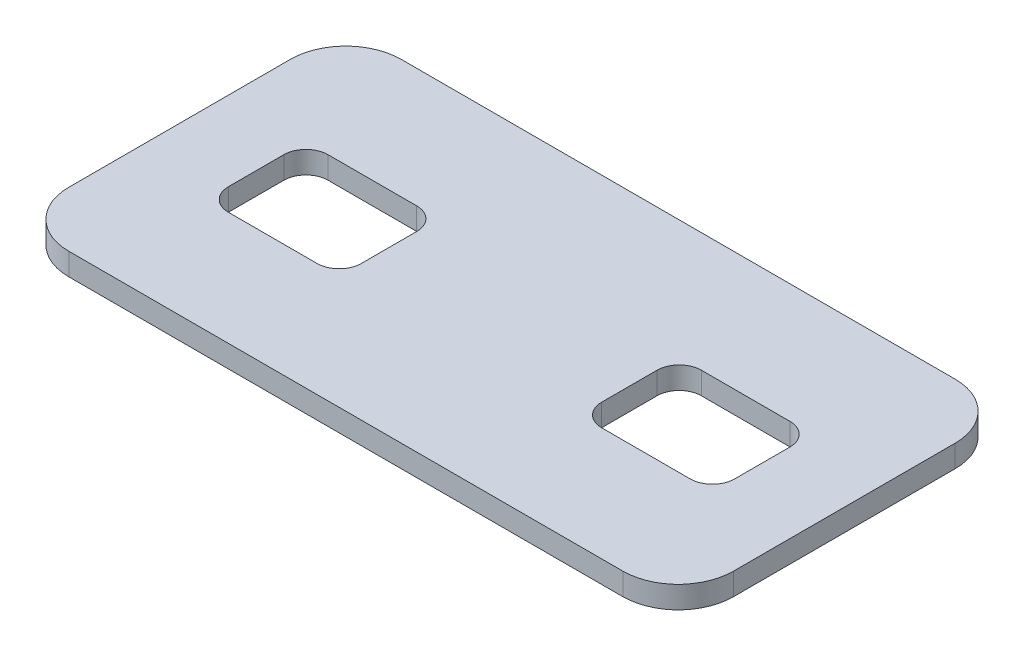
ISO-10303-21;
HEADER;
FILE_DESCRIPTION(('STEP AP214'),'2;1');
FILE_NAME('part.step','',(''),(''),'','','');
FILE_SCHEMA(('AUTOMOTIVE_DESIGN { 1 0 10303 214 1 1 1 1 }'));
ENDSEC;
DATA;
#1=APPLICATION_CONTEXT('core data for automotive mechanical design processes');
#2=APPLICATION_PROTOCOL_DEFINITION('international standard','automotive_design',2000,#1);
#3=PRODUCT_CONTEXT('',#1,'mechanical');
#4=PRODUCT('Part','Part','',(#3));
#5=PRODUCT_RELATED_PRODUCT_CATEGORY('part','',(#4));
#6=PRODUCT_DEFINITION_FORMATION('','',#4);
#7=PRODUCT_DEFINITION_CONTEXT('part definition',#1,'design');
#8=PRODUCT_DEFINITION('design','',#6,#7);
#9=PRODUCT_DEFINITION_SHAPE('','',#8);
#10=(LENGTH_UNIT() NAMED_UNIT(*) SI_UNIT(.MILLI.,.METRE.));
#11=(NAMED_UNIT(*) PLANE_ANGLE_UNIT() SI_UNIT($,.RADIAN.));
#12=(NAMED_UNIT(*) SI_UNIT($,.STERADIAN.) SOLID_ANGLE_UNIT());
#13=UNCERTAINTY_MEASURE_WITH_UNIT(LENGTH_MEASURE(1.E-05),#10,'distance_accuracy_value','');
#14=(GEOMETRIC_REPRESENTATION_CONTEXT(3) GLOBAL_UNCERTAINTY_ASSIGNED_CONTEXT((#13)) GLOBAL_UNIT_ASSIGNED_CONTEXT((#10,
#11,#12)) REPRESENTATION_CONTEXT('',''));
#15=CARTESIAN_POINT('',(0.,0.,0.));
#16=DIRECTION('',(0.,0.,1.));
#17=DIRECTION('',(1.,0.,0.));
#18=AXIS2_PLACEMENT_3D('',#15,#16,#17);
#19=CARTESIAN_POINT('',(0.,0.,7.9419889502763));
#20=DIRECTION('',(0.,0.,-1.));
#21=DIRECTION('',(-1.,0.,0.));
#22=AXIS2_PLACEMENT_3D('',#19,#20,#21);
#23=PLANE('',#22);
#24=DIRECTION('',(0.,1.,0.));
#25=VECTOR('',#24,1.);
#26=CARTESIAN_POINT('',(-21.8720073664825,0.,7.94198895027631));
#27=LINE('',#26,#25);
#28=CARTESIAN_POINT('',(-21.8720073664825,3.,7.94198895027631));
#29=VERTEX_POINT('',#28);
#30=CARTESIAN_POINT('',(-21.8720073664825,5.,7.94198895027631));
#31=VERTEX_POINT('',#30);
#32=EDGE_CURVE('E377',#29,#31,#27,.T.);
#33=ORIENTED_EDGE('',*,*,#32,.T.);
#34=DIRECTION('',(1.,0.,0.));
#35=VECTOR('',#34,1.);
#36=CARTESIAN_POINT('',(0.,5.,7.9419889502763));
#37=LINE('',#36,#35);
#38=CARTESIAN_POINT('',(28.1279926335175,5.,7.9419889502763));
#39=VERTEX_POINT('',#38);
#40=EDGE_CURVE('E356',#31,#39,#37,.T.);
#41=ORIENTED_EDGE('',*,*,#40,.T.);
#42=DIRECTION('',(0.,1.,0.));
#43=VECTOR('',#42,1.);
#44=CARTESIAN_POINT('',(28.1279926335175,0.,7.9419889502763));
#45=LINE('',#44,#43);
#46=CARTESIAN_POINT('',(28.1279926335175,3.,7.9419889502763));
#47=VERTEX_POINT('',#46);
#48=EDGE_CURVE('E397',#47,#39,#45,.T.);
#49=ORIENTED_EDGE('',*,*,#48,.F.);
#50=DIRECTION('',(1.,0.,0.));
#51=VECTOR('',#50,1.);
#52=CARTESIAN_POINT('',(0.,3.,7.9419889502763));
#53=LINE('',#52,#51);
#54=EDGE_CURVE('E375',#29,#47,#53,.T.);
#55=ORIENTED_EDGE('',*,*,#54,.F.);
#56=EDGE_LOOP('',(#33,#41,#49,#55));
#57=FACE_BOUND('',#56,.T.);
#58=ADVANCED_FACE('F90',(#57),#23,.T.);
#59=CARTESIAN_POINT('',(-21.8720073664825,0.,12.9419889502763));
#60=DIRECTION('',(0.,1.,0.));
#61=DIRECTION('',(0.,0.,1.));
#62=AXIS2_PLACEMENT_3D('',#59,#60,#61);
#63=CYLINDRICAL_SURFACE('',#62,5.);
#64=CARTESIAN_POINT('',(-21.8720073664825,5.,12.9419889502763));
#65=DIRECTION('',(0.,1.,0.));
#66=DIRECTION('',(0.,0.,1.));
#67=AXIS2_PLACEMENT_3D('',#64,#65,#66);
#68=CIRCLE('',#67,5.);
#69=CARTESIAN_POINT('',(-26.8720073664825,5.,12.9419889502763));
#70=VERTEX_POINT('',#69);
#71=EDGE_CURVE('E354',#31,#70,#68,.T.);
#72=ORIENTED_EDGE('',*,*,#71,.F.);
#73=ORIENTED_EDGE('',*,*,#32,.F.);
#74=CARTESIAN_POINT('',(-21.8720073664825,3.,12.9419889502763));
#75=DIRECTION('',(0.,1.,0.));
#76=DIRECTION('',(0.,0.,1.));
#77=AXIS2_PLACEMENT_3D('',#74,#75,#76);
#78=CIRCLE('',#77,5.);
#79=CARTESIAN_POINT('',(-26.8720073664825,3.,12.9419889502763));
#80=VERTEX_POINT('',#79);
#81=EDGE_CURVE('E372',#29,#80,#78,.T.);
#82=ORIENTED_EDGE('',*,*,#81,.T.);
#83=DIRECTION('',(0.,1.,0.));
#84=VECTOR('',#83,1.);
#85=CARTESIAN_POINT('',(-26.8720073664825,0.,12.9419889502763));
#86=LINE('',#85,#84);
#87=EDGE_CURVE('E378',#80,#70,#86,.T.);
#88=ORIENTED_EDGE('',*,*,#87,.T.);
#89=EDGE_LOOP('',(#72,#73,#82,#88));
#90=FACE_BOUND('',#89,.T.);
#91=ADVANCED_FACE('F92',(#90),#63,.T.);
#92=CARTESIAN_POINT('',(-26.8720073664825,0.,0.));
#93=DIRECTION('',(1.,0.,0.));
#94=DIRECTION('',(0.,0.,-1.));
#95=AXIS2_PLACEMENT_3D('',#92,#93,#94);
#96=PLANE('',#95);
#97=DIRECTION('',(0.,0.,1.));
#98=VECTOR('',#97,1.);
#99=CARTESIAN_POINT('',(-26.8720073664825,5.,0.));
#100=LINE('',#99,#98);
#101=CARTESIAN_POINT('',(-26.8720073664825,5.,32.9419889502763));
#102=VERTEX_POINT('',#101);
#103=EDGE_CURVE('E352',#70,#102,#100,.T.);
#104=ORIENTED_EDGE('',*,*,#103,.F.);
#105=ORIENTED_EDGE('',*,*,#87,.F.);
#106=DIRECTION('',(0.,0.,1.));
#107=VECTOR('',#106,1.);
#108=CARTESIAN_POINT('',(-26.8720073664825,3.,0.));
#109=LINE('',#108,#107);
#110=CARTESIAN_POINT('',(-26.8720073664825,3.,32.9419889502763));
#111=VERTEX_POINT('',#110);
#112=EDGE_CURVE('E369',#80,#111,#109,.T.);
#113=ORIENTED_EDGE('',*,*,#112,.T.);
#114=DIRECTION('',(0.,1.,0.));
#115=VECTOR('',#114,1.);
#116=CARTESIAN_POINT('',(-26.8720073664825,0.,32.9419889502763));
#117=LINE('',#116,#115);
#118=EDGE_CURVE('E382',#111,#102,#117,.T.);
#119=ORIENTED_EDGE('',*,*,#118,.T.);
#120=EDGE_LOOP('',(#104,#105,#113,#119));
#121=FACE_BOUND('',#120,.T.);
#122=ADVANCED_FACE('F479',(#121),#96,.F.);
#123=CARTESIAN_POINT('',(-21.8720073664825,0.,32.9419889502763));
#124=DIRECTION('',(0.,1.,0.));
#125=DIRECTION('',(0.,0.,1.));
#126=AXIS2_PLACEMENT_3D('',#123,#124,#125);
#127=CYLINDRICAL_SURFACE('',#126,5.);
#128=CARTESIAN_POINT('',(-21.8720073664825,5.,32.9419889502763));
#129=DIRECTION('',(0.,1.,0.));
#130=DIRECTION('',(0.,0.,1.));
#131=AXIS2_PLACEMENT_3D('',#128,#129,#130);
#132=CIRCLE('',#131,5.);
#133=CARTESIAN_POINT('',(-21.8720073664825,5.,37.9419889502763));
#134=VERTEX_POINT('',#133);
#135=EDGE_CURVE('E350',#102,#134,#132,.T.);
#136=ORIENTED_EDGE('',*,*,#135,.F.);
#137=ORIENTED_EDGE('',*,*,#118,.F.);
#138=CARTESIAN_POINT('',(-21.8720073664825,3.,32.9419889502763));
#139=DIRECTION('',(0.,1.,0.));
#140=DIRECTION('',(0.,0.,1.));
#141=AXIS2_PLACEMENT_3D('',#138,#139,#140);
#142=CIRCLE('',#141,5.);
#143=CARTESIAN_POINT('',(-21.8720073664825,3.,37.9419889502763));
#144=VERTEX_POINT('',#143);
#145=EDGE_CURVE('E366',#111,#144,#142,.T.);
#146=ORIENTED_EDGE('',*,*,#145,.T.);
#147=DIRECTION('',(0.,1.,0.));
#148=VECTOR('',#147,1.);
#149=CARTESIAN_POINT('',(-21.8720073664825,0.,37.9419889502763));
#150=LINE('',#149,#148);
#151=EDGE_CURVE('E385',#144,#134,#150,.T.);
#152=ORIENTED_EDGE('',*,*,#151,.T.);
#153=EDGE_LOOP('',(#136,#137,#146,#152));
#154=FACE_BOUND('',#153,.T.);
#155=ADVANCED_FACE('F497',(#154),#127,.T.);
#156=CARTESIAN_POINT('',(0.,0.,37.9419889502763));
#157=DIRECTION('',(0.,0.,-1.));
#158=DIRECTION('',(-1.,0.,0.));
#159=AXIS2_PLACEMENT_3D('',#156,#157,#158);
#160=PLANE('',#159);
#161=DIRECTION('',(1.,0.,0.));
#162=VECTOR('',#161,1.);
#163=CARTESIAN_POINT('',(0.,5.,37.9419889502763));
#164=LINE('',#163,#162);
#165=CARTESIAN_POINT('',(28.1279926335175,5.,37.9419889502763));
#166=VERTEX_POINT('',#165);
#167=EDGE_CURVE('E348',#134,#166,#164,.T.);
#168=ORIENTED_EDGE('',*,*,#167,.F.);
#169=ORIENTED_EDGE('',*,*,#151,.F.);
#170=DIRECTION('',(1.,0.,0.));
#171=VECTOR('',#170,1.);
#172=CARTESIAN_POINT('',(0.,3.,37.9419889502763));
#173=LINE('',#172,#171);
#174=CARTESIAN_POINT('',(28.1279926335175,3.,37.9419889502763));
#175=VERTEX_POINT('',#174);
#176=EDGE_CURVE('E363',#144,#175,#173,.T.);
#177=ORIENTED_EDGE('',*,*,#176,.T.);
#178=DIRECTION('',(0.,1.,0.));
#179=VECTOR('',#178,1.);
#180=CARTESIAN_POINT('',(28.1279926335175,0.,37.9419889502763));
#181=LINE('',#180,#179);
#182=EDGE_CURVE('E388',#175,#166,#181,.T.);
#183=ORIENTED_EDGE('',*,*,#182,.T.);
#184=EDGE_LOOP('',(#168,#169,#177,#183));
#185=FACE_BOUND('',#184,.T.);
#186=ADVANCED_FACE('F493',(#185),#160,.F.);
#187=CARTESIAN_POINT('',(28.1279926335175,0.,32.9419889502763));
#188=DIRECTION('',(0.,1.,0.));
#189=DIRECTION('',(0.,0.,1.));
#190=AXIS2_PLACEMENT_3D('',#187,#188,#189);
#191=CYLINDRICAL_SURFACE('',#190,5.);
#192=DIRECTION('',(0.,1.,0.));
#193=VECTOR('',#192,1.);
#194=CARTESIAN_POINT('',(33.1279926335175,0.,32.9419889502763));
#195=LINE('',#194,#193);
#196=CARTESIAN_POINT('',(33.1279926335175,3.,32.9419889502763));
#197=VERTEX_POINT('',#196);
#198=CARTESIAN_POINT('',(33.1279926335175,5.,32.9419889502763));
#199=VERTEX_POINT('',#198);
#200=EDGE_CURVE('E391',#197,#199,#195,.T.);
#201=ORIENTED_EDGE('',*,*,#200,.T.);
#202=CARTESIAN_POINT('',(28.1279926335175,5.,32.9419889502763));
#203=DIRECTION('',(0.,1.,0.));
#204=DIRECTION('',(0.,0.,1.));
#205=AXIS2_PLACEMENT_3D('',#202,#203,#204);
#206=CIRCLE('',#205,5.);
#207=EDGE_CURVE('E345',#199,#166,#206,.F.);
#208=ORIENTED_EDGE('',*,*,#207,.T.);
#209=ORIENTED_EDGE('',*,*,#182,.F.);
#210=CARTESIAN_POINT('',(28.1279926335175,3.,32.9419889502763));
#211=DIRECTION('',(0.,1.,0.));
#212=DIRECTION('',(0.,0.,1.));
#213=AXIS2_PLACEMENT_3D('',#210,#211,#212);
#214=CIRCLE('',#213,5.);
#215=EDGE_CURVE('E361',#197,#175,#214,.F.);
#216=ORIENTED_EDGE('',*,*,#215,.F.);
#217=EDGE_LOOP('',(#201,#208,#209,#216));
#218=FACE_BOUND('',#217,.T.);
#219=ADVANCED_FACE('F489',(#218),#191,.T.);
#220=CARTESIAN_POINT('',(33.1279926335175,0.,0.));
#221=DIRECTION('',(1.,0.,0.));
#222=DIRECTION('',(0.,0.,-1.));
#223=AXIS2_PLACEMENT_3D('',#220,#221,#222);
#224=PLANE('',#223);
#225=DIRECTION('',(0.,1.,0.));
#226=VECTOR('',#225,1.);
#227=CARTESIAN_POINT('',(33.1279926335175,0.,12.9419889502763));
#228=LINE('',#227,#226);
#229=CARTESIAN_POINT('',(33.1279926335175,3.,12.9419889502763));
#230=VERTEX_POINT('',#229);
#231=CARTESIAN_POINT('',(33.1279926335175,5.,12.9419889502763));
#232=VERTEX_POINT('',#231);
#233=EDGE_CURVE('E394',#230,#232,#228,.T.);
#234=ORIENTED_EDGE('',*,*,#233,.T.);
#235=DIRECTION('',(0.,0.,1.));
#236=VECTOR('',#235,1.);
#237=CARTESIAN_POINT('',(33.1279926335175,5.,0.));
#238=LINE('',#237,#236);
#239=EDGE_CURVE('E294',#232,#199,#238,.T.);
#240=ORIENTED_EDGE('',*,*,#239,.T.);
#241=ORIENTED_EDGE('',*,*,#200,.F.);
#242=DIRECTION('',(0.,0.,1.));
#243=VECTOR('',#242,1.);
#244=CARTESIAN_POINT('',(33.1279926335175,3.,0.));
#245=LINE('',#244,#243);
#246=EDGE_CURVE('E359',#230,#197,#245,.T.);
#247=ORIENTED_EDGE('',*,*,#246,.F.);
#248=EDGE_LOOP('',(#234,#240,#241,#247));
#249=FACE_BOUND('',#248,.T.);
#250=ADVANCED_FACE('F485',(#249),#224,.T.);
#251=CARTESIAN_POINT('',(28.1279926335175,0.,12.9419889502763));
#252=DIRECTION('',(0.,1.,0.));
#253=DIRECTION('',(0.,0.,1.));
#254=AXIS2_PLACEMENT_3D('',#251,#252,#253);
#255=CYLINDRICAL_SURFACE('',#254,5.);
#256=ORIENTED_EDGE('',*,*,#48,.T.);
#257=CARTESIAN_POINT('',(28.1279926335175,5.,12.9419889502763));
#258=DIRECTION('',(0.,1.,0.));
#259=DIRECTION('',(0.,0.,1.));
#260=AXIS2_PLACEMENT_3D('',#257,#258,#259);
#261=CIRCLE('',#260,5.);
#262=EDGE_CURVE('E403',#39,#232,#261,.F.);
#263=ORIENTED_EDGE('',*,*,#262,.T.);
#264=ORIENTED_EDGE('',*,*,#233,.F.);
#265=CARTESIAN_POINT('',(28.1279926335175,3.,12.9419889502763));
#266=DIRECTION('',(0.,1.,0.));
#267=DIRECTION('',(0.,0.,1.));
#268=AXIS2_PLACEMENT_3D('',#265,#266,#267);
#269=CIRCLE('',#268,5.);
#270=EDGE_CURVE('E381',#47,#230,#269,.F.);
#271=ORIENTED_EDGE('',*,*,#270,.F.);
#272=EDGE_LOOP('',(#256,#263,#264,#271));
#273=FACE_BOUND('',#272,.T.);
#274=ADVANCED_FACE('F482',(#273),#255,.T.);
#275=CARTESIAN_POINT('',(19.9718751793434,3.,23.1954761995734));
#276=DIRECTION('',(0.,1.,0.));
#277=DIRECTION('',(0.,0.,1.));
#278=AXIS2_PLACEMENT_3D('',#275,#276,#277);
#279=PLANE('',#278);
#280=DIRECTION('',(0.,0.,1.));
#281=VECTOR('',#280,1.);
#282=CARTESIAN_POINT('',(-7.71588991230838,3.,20.6954761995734));
#283=LINE('',#282,#281);
#284=CARTESIAN_POINT('',(-7.71588991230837,3.,20.6954761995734));
#285=VERTEX_POINT('',#284);
#286=CARTESIAN_POINT('',(-7.71588991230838,3.,25.6954761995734));
#287=VERTEX_POINT('',#286);
#288=EDGE_CURVE('E267',#285,#287,#283,.T.);
#289=ORIENTED_EDGE('',*,*,#288,.F.);
#290=CARTESIAN_POINT('',(-9.71588991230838,3.,20.6954761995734));
#291=DIRECTION('',(0.,-1.,0.));
#292=DIRECTION('',(0.,0.,1.));
#293=AXIS2_PLACEMENT_3D('',#290,#291,#292);
#294=CIRCLE('',#293,2.);
#295=CARTESIAN_POINT('',(-9.71588991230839,3.,18.6954761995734));
#296=VERTEX_POINT('',#295);
#297=EDGE_CURVE('E105',#296,#285,#294,.T.);
#298=ORIENTED_EDGE('',*,*,#297,.F.);
#299=DIRECTION('',(1.,0.,0.));
#300=VECTOR('',#299,1.);
#301=CARTESIAN_POINT('',(-17.7158899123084,3.,18.6954761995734));
#302=LINE('',#301,#300);
#303=CARTESIAN_POINT('',(-17.7158899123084,3.,18.6954761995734));
#304=VERTEX_POINT('',#303);
#305=EDGE_CURVE('E289',#304,#296,#302,.T.);
#306=ORIENTED_EDGE('',*,*,#305,.F.);
#307=CARTESIAN_POINT('',(-17.7158899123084,3.,20.6954761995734));
#308=DIRECTION('',(0.,-1.,0.));
#309=DIRECTION('',(0.,0.,1.));
#310=AXIS2_PLACEMENT_3D('',#307,#308,#309);
#311=CIRCLE('',#310,2.);
#312=CARTESIAN_POINT('',(-19.7158899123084,3.,20.6954761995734));
#313=VERTEX_POINT('',#312);
#314=EDGE_CURVE('E286',#313,#304,#311,.T.);
#315=ORIENTED_EDGE('',*,*,#314,.F.);
#316=DIRECTION('',(0.,0.,-1.));
#317=VECTOR('',#316,1.);
#318=CARTESIAN_POINT('',(-19.7158899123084,3.,20.6954761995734));
#319=LINE('',#318,#317);
#320=CARTESIAN_POINT('',(-19.7158899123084,3.,25.6954761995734));
#321=VERTEX_POINT('',#320);
#322=EDGE_CURVE('E283',#321,#313,#319,.T.);
#323=ORIENTED_EDGE('',*,*,#322,.F.);
#324=CARTESIAN_POINT('',(-17.7158899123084,3.,25.6954761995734));
#325=DIRECTION('',(0.,-1.,0.));
#326=DIRECTION('',(0.,0.,1.));
#327=AXIS2_PLACEMENT_3D('',#324,#325,#326);
#328=CIRCLE('',#327,2.);
#329=CARTESIAN_POINT('',(-17.7158899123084,3.,27.6954761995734));
#330=VERTEX_POINT('',#329);
#331=EDGE_CURVE('E277',#330,#321,#328,.T.);
#332=ORIENTED_EDGE('',*,*,#331,.F.);
#333=DIRECTION('',(-1.,0.,0.));
#334=VECTOR('',#333,1.);
#335=CARTESIAN_POINT('',(-17.7158899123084,3.,27.6954761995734));
#336=LINE('',#335,#334);
#337=CARTESIAN_POINT('',(-9.71588991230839,3.,27.6954761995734));
#338=VERTEX_POINT('',#337);
#339=EDGE_CURVE('E275',#338,#330,#336,.T.);
#340=ORIENTED_EDGE('',*,*,#339,.F.);
#341=CARTESIAN_POINT('',(-9.71588991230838,3.,25.6954761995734));
#342=DIRECTION('',(0.,-1.,0.));
#343=DIRECTION('',(0.,0.,1.));
#344=AXIS2_PLACEMENT_3D('',#341,#342,#343);
#345=CIRCLE('',#344,2.);
#346=EDGE_CURVE('E257',#287,#338,#345,.T.);
#347=ORIENTED_EDGE('',*,*,#346,.F.);
#348=EDGE_LOOP('',(#289,#298,#306,#315,#323,#332,#340,#347));
#349=FACE_BOUND('',#348,.T.);
#350=DIRECTION('',(0.,0.,-1.));
#351=VECTOR('',#350,1.);
#352=CARTESIAN_POINT('',(13.9718751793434,3.,20.6954761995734));
#353=LINE('',#352,#351);
#354=CARTESIAN_POINT('',(13.9718751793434,3.,25.6954761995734));
#355=VERTEX_POINT('',#354);
#356=CARTESIAN_POINT('',(13.9718751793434,3.,20.6954761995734));
#357=VERTEX_POINT('',#356);
#358=EDGE_CURVE('E339',#355,#357,#353,.T.);
#359=ORIENTED_EDGE('',*,*,#358,.F.);
#360=CARTESIAN_POINT('',(15.9718751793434,3.,25.6954761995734));
#361=DIRECTION('',(0.,-1.,0.));
#362=DIRECTION('',(0.,0.,-1.));
#363=AXIS2_PLACEMENT_3D('',#360,#361,#362);
#364=CIRCLE('',#363,2.);
#365=CARTESIAN_POINT('',(15.9718751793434,3.,27.6954761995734));
#366=VERTEX_POINT('',#365);
#367=EDGE_CURVE('E113',#366,#355,#364,.T.);
#368=ORIENTED_EDGE('',*,*,#367,.F.);
#369=DIRECTION('',(-1.,0.,0.));
#370=VECTOR('',#369,1.);
#371=CARTESIAN_POINT('',(15.9718751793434,3.,27.6954761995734));
#372=LINE('',#371,#370);
#373=CARTESIAN_POINT('',(23.9718751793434,3.,27.6954761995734));
#374=VERTEX_POINT('',#373);
#375=EDGE_CURVE('E307',#374,#366,#372,.T.);
#376=ORIENTED_EDGE('',*,*,#375,.F.);
#377=CARTESIAN_POINT('',(23.9718751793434,3.,25.6954761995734));
#378=DIRECTION('',(0.,-1.,0.));
#379=DIRECTION('',(0.,0.,-1.));
#380=AXIS2_PLACEMENT_3D('',#377,#378,#379);
#381=CIRCLE('',#380,2.);
#382=CARTESIAN_POINT('',(25.9718751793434,3.,25.6954761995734));
#383=VERTEX_POINT('',#382);
#384=EDGE_CURVE('E324',#383,#374,#381,.T.);
#385=ORIENTED_EDGE('',*,*,#384,.F.);
#386=DIRECTION('',(0.,0.,1.));
#387=VECTOR('',#386,1.);
#388=CARTESIAN_POINT('',(25.9718751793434,3.,20.6954761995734));
#389=LINE('',#388,#387);
#390=CARTESIAN_POINT('',(25.9718751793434,3.,20.6954761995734));
#391=VERTEX_POINT('',#390);
#392=EDGE_CURVE('E327',#391,#383,#389,.T.);
#393=ORIENTED_EDGE('',*,*,#392,.F.);
#394=CARTESIAN_POINT('',(23.9718751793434,3.,20.6954761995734));
#395=DIRECTION('',(0.,-1.,0.));
#396=DIRECTION('',(0.,0.,-1.));
#397=AXIS2_PLACEMENT_3D('',#394,#395,#396);
#398=CIRCLE('',#397,2.);
#399=CARTESIAN_POINT('',(23.9718751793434,3.,18.6954761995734));
#400=VERTEX_POINT('',#399);
#401=EDGE_CURVE('E330',#400,#391,#398,.T.);
#402=ORIENTED_EDGE('',*,*,#401,.F.);
#403=DIRECTION('',(1.,0.,0.));
#404=VECTOR('',#403,1.);
#405=CARTESIAN_POINT('',(15.9718751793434,3.,18.6954761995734));
#406=LINE('',#405,#404);
#407=CARTESIAN_POINT('',(15.9718751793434,3.,18.6954761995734));
#408=VERTEX_POINT('',#407);
#409=EDGE_CURVE('E333',#408,#400,#406,.T.);
#410=ORIENTED_EDGE('',*,*,#409,.F.);
#411=CARTESIAN_POINT('',(15.9718751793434,3.,20.6954761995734));
#412=DIRECTION('',(0.,-1.,0.));
#413=DIRECTION('',(0.,0.,1.));
#414=AXIS2_PLACEMENT_3D('',#411,#412,#413);
#415=CIRCLE('',#414,2.);
#416=EDGE_CURVE('E336',#357,#408,#415,.T.);
#417=ORIENTED_EDGE('',*,*,#416,.F.);
#418=EDGE_LOOP('',(#359,#368,#376,#385,#393,#402,#410,#417));
#419=FACE_BOUND('',#418,.T.);
#420=ORIENTED_EDGE('',*,*,#54,.T.);
#421=ORIENTED_EDGE('',*,*,#270,.T.);
#422=ORIENTED_EDGE('',*,*,#246,.T.);
#423=ORIENTED_EDGE('',*,*,#215,.T.);
#424=ORIENTED_EDGE('',*,*,#176,.F.);
#425=ORIENTED_EDGE('',*,*,#145,.F.);
#426=ORIENTED_EDGE('',*,*,#112,.F.);
#427=ORIENTED_EDGE('',*,*,#81,.F.);
#428=EDGE_LOOP('',(#420,#421,#422,#423,#424,#425,#426,#427));
#429=FACE_BOUND('',#428,.T.);
#430=ADVANCED_FACE('F271',(#349,#419,#429),#279,.F.);
#431=CARTESIAN_POINT('',(0.,5.,0.));
#432=DIRECTION('',(0.,1.,0.));
#433=DIRECTION('',(0.,0.,1.));
#434=AXIS2_PLACEMENT_3D('',#431,#432,#433);
#435=PLANE('',#434);
#436=CARTESIAN_POINT('',(-9.71588991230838,5.,20.6954761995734));
#437=DIRECTION('',(0.,1.,0.));
#438=DIRECTION('',(0.,0.,1.));
#439=AXIS2_PLACEMENT_3D('',#436,#437,#438);
#440=CIRCLE('',#439,2.);
#441=CARTESIAN_POINT('',(-7.71588991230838,5.,20.6954761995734));
#442=VERTEX_POINT('',#441);
#443=CARTESIAN_POINT('',(-9.71588991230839,5.,18.6954761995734));
#444=VERTEX_POINT('',#443);
#445=EDGE_CURVE('E12',#442,#444,#440,.T.);
#446=ORIENTED_EDGE('',*,*,#445,.F.);
#447=DIRECTION('',(0.,0.,-1.));
#448=VECTOR('',#447,1.);
#449=CARTESIAN_POINT('',(-7.71588991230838,5.,0.));
#450=LINE('',#449,#448);
#451=CARTESIAN_POINT('',(-7.71588991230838,5.,25.6954761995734));
#452=VERTEX_POINT('',#451);
#453=EDGE_CURVE('E423',#452,#442,#450,.T.);
#454=ORIENTED_EDGE('',*,*,#453,.F.);
#455=CARTESIAN_POINT('',(-9.71588991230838,5.,25.6954761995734));
#456=DIRECTION('',(0.,1.,0.));
#457=DIRECTION('',(0.,0.,1.));
#458=AXIS2_PLACEMENT_3D('',#455,#456,#457);
#459=CIRCLE('',#458,2.);
#460=CARTESIAN_POINT('',(-9.71588991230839,5.,27.6954761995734));
#461=VERTEX_POINT('',#460);
#462=EDGE_CURVE('E260',#461,#452,#459,.T.);
#463=ORIENTED_EDGE('',*,*,#462,.F.);
#464=DIRECTION('',(1.,0.,0.));
#465=VECTOR('',#464,1.);
#466=CARTESIAN_POINT('',(0.,5.,27.6954761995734));
#467=LINE('',#466,#465);
#468=CARTESIAN_POINT('',(-17.7158899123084,5.,27.6954761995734));
#469=VERTEX_POINT('',#468);
#470=EDGE_CURVE('E426',#469,#461,#467,.T.);
#471=ORIENTED_EDGE('',*,*,#470,.F.);
#472=CARTESIAN_POINT('',(-17.7158899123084,5.,25.6954761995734));
#473=DIRECTION('',(0.,1.,0.));
#474=DIRECTION('',(0.,0.,1.));
#475=AXIS2_PLACEMENT_3D('',#472,#473,#474);
#476=CIRCLE('',#475,2.);
#477=CARTESIAN_POINT('',(-19.7158899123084,5.,25.6954761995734));
#478=VERTEX_POINT('',#477);
#479=EDGE_CURVE('E428',#478,#469,#476,.T.);
#480=ORIENTED_EDGE('',*,*,#479,.F.);
#481=DIRECTION('',(0.,0.,1.));
#482=VECTOR('',#481,1.);
#483=CARTESIAN_POINT('',(-19.7158899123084,5.,0.));
#484=LINE('',#483,#482);
#485=CARTESIAN_POINT('',(-19.7158899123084,5.,20.6954761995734));
#486=VERTEX_POINT('',#485);
#487=EDGE_CURVE('E430',#486,#478,#484,.T.);
#488=ORIENTED_EDGE('',*,*,#487,.F.);
#489=CARTESIAN_POINT('',(-17.7158899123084,5.,20.6954761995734));
#490=DIRECTION('',(0.,1.,0.));
#491=DIRECTION('',(0.,0.,1.));
#492=AXIS2_PLACEMENT_3D('',#489,#490,#491);
#493=CIRCLE('',#492,2.);
#494=CARTESIAN_POINT('',(-17.7158899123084,5.,18.6954761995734));
#495=VERTEX_POINT('',#494);
#496=EDGE_CURVE('E432',#495,#486,#493,.T.);
#497=ORIENTED_EDGE('',*,*,#496,.F.);
#498=DIRECTION('',(-1.,0.,0.));
#499=VECTOR('',#498,1.);
#500=CARTESIAN_POINT('',(0.,5.,18.6954761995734));
#501=LINE('',#500,#499);
#502=EDGE_CURVE('E98',#444,#495,#501,.T.);
#503=ORIENTED_EDGE('',*,*,#502,.F.);
#504=EDGE_LOOP('',(#446,#454,#463,#471,#480,#488,#497,#503));
#505=FACE_BOUND('',#504,.T.);
#506=CARTESIAN_POINT('',(15.9718751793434,5.,25.6954761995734));
#507=DIRECTION('',(0.,1.,0.));
#508=DIRECTION('',(0.,0.,1.));
#509=AXIS2_PLACEMENT_3D('',#506,#507,#508);
#510=CIRCLE('',#509,2.);
#511=CARTESIAN_POINT('',(13.9718751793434,5.,25.6954761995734));
#512=VERTEX_POINT('',#511);
#513=CARTESIAN_POINT('',(15.9718751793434,5.,27.6954761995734));
#514=VERTEX_POINT('',#513);
#515=EDGE_CURVE('E421',#512,#514,#510,.T.);
#516=ORIENTED_EDGE('',*,*,#515,.F.);
#517=DIRECTION('',(0.,0.,1.));
#518=VECTOR('',#517,1.);
#519=CARTESIAN_POINT('',(13.9718751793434,5.,0.));
#520=LINE('',#519,#518);
#521=CARTESIAN_POINT('',(13.9718751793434,5.,20.6954761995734));
#522=VERTEX_POINT('',#521);
#523=EDGE_CURVE('E406',#522,#512,#520,.T.);
#524=ORIENTED_EDGE('',*,*,#523,.F.);
#525=CARTESIAN_POINT('',(15.9718751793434,5.,20.6954761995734));
#526=DIRECTION('',(0.,1.,0.));
#527=DIRECTION('',(0.,0.,1.));
#528=AXIS2_PLACEMENT_3D('',#525,#526,#527);
#529=CIRCLE('',#528,2.);
#530=CARTESIAN_POINT('',(15.9718751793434,5.,18.6954761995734));
#531=VERTEX_POINT('',#530);
#532=EDGE_CURVE('E408',#531,#522,#529,.T.);
#533=ORIENTED_EDGE('',*,*,#532,.F.);
#534=DIRECTION('',(-1.,0.,0.));
#535=VECTOR('',#534,1.);
#536=CARTESIAN_POINT('',(0.,5.,18.6954761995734));
#537=LINE('',#536,#535);
#538=CARTESIAN_POINT('',(23.9718751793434,5.,18.6954761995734));
#539=VERTEX_POINT('',#538);
#540=EDGE_CURVE('E411',#539,#531,#537,.T.);
#541=ORIENTED_EDGE('',*,*,#540,.F.);
#542=CARTESIAN_POINT('',(23.9718751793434,5.,20.6954761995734));
#543=DIRECTION('',(0.,1.,0.));
#544=DIRECTION('',(0.,0.,1.));
#545=AXIS2_PLACEMENT_3D('',#542,#543,#544);
#546=CIRCLE('',#545,2.);
#547=CARTESIAN_POINT('',(25.9718751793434,5.,20.6954761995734));
#548=VERTEX_POINT('',#547);
#549=EDGE_CURVE('E413',#548,#539,#546,.T.);
#550=ORIENTED_EDGE('',*,*,#549,.F.);
#551=DIRECTION('',(0.,0.,-1.));
#552=VECTOR('',#551,1.);
#553=CARTESIAN_POINT('',(25.9718751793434,5.,0.));
#554=LINE('',#553,#552);
#555=CARTESIAN_POINT('',(25.9718751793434,5.,25.6954761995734));
#556=VERTEX_POINT('',#555);
#557=EDGE_CURVE('E415',#556,#548,#554,.T.);
#558=ORIENTED_EDGE('',*,*,#557,.F.);
#559=CARTESIAN_POINT('',(23.9718751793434,5.,25.6954761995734));
#560=DIRECTION('',(0.,1.,0.));
#561=DIRECTION('',(0.,0.,1.));
#562=AXIS2_PLACEMENT_3D('',#559,#560,#561);
#563=CIRCLE('',#562,2.);
#564=CARTESIAN_POINT('',(23.9718751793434,5.,27.6954761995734));
#565=VERTEX_POINT('',#564);
#566=EDGE_CURVE('E417',#565,#556,#563,.T.);
#567=ORIENTED_EDGE('',*,*,#566,.F.);
#568=DIRECTION('',(1.,0.,0.));
#569=VECTOR('',#568,1.);
#570=CARTESIAN_POINT('',(0.,5.,27.6954761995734));
#571=LINE('',#570,#569);
#572=EDGE_CURVE('E419',#514,#565,#571,.T.);
#573=ORIENTED_EDGE('',*,*,#572,.F.);
#574=EDGE_LOOP('',(#516,#524,#533,#541,#550,#558,#567,#573));
#575=FACE_BOUND('',#574,.T.);
#576=ORIENTED_EDGE('',*,*,#71,.T.);
#577=ORIENTED_EDGE('',*,*,#103,.T.);
#578=ORIENTED_EDGE('',*,*,#135,.T.);
#579=ORIENTED_EDGE('',*,*,#167,.T.);
#580=ORIENTED_EDGE('',*,*,#207,.F.);
#581=ORIENTED_EDGE('',*,*,#239,.F.);
#582=ORIENTED_EDGE('',*,*,#262,.F.);
#583=ORIENTED_EDGE('',*,*,#40,.F.);
#584=EDGE_LOOP('',(#576,#577,#578,#579,#580,#581,#582,#583));
#585=FACE_BOUND('',#584,.T.);
#586=ADVANCED_FACE('F447',(#505,#575,#585),#435,.T.);
#587=CARTESIAN_POINT('',(15.9718751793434,13.,25.6954761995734));
#588=DIRECTION('',(0.,-1.,0.));
#589=DIRECTION('',(0.,0.,-1.));
#590=AXIS2_PLACEMENT_3D('',#587,#588,#589);
#591=CYLINDRICAL_SURFACE('',#590,2.);
#592=ORIENTED_EDGE('',*,*,#515,.T.);
#593=DIRECTION('',(0.,-1.,0.));
#594=VECTOR('',#593,1.);
#595=CARTESIAN_POINT('',(15.9718751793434,13.,27.6954761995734));
#596=LINE('',#595,#594);
#597=EDGE_CURVE('E320',#514,#366,#596,.T.);
#598=ORIENTED_EDGE('',*,*,#597,.T.);
#599=ORIENTED_EDGE('',*,*,#367,.T.);
#600=DIRECTION('',(0.,-1.,0.));
#601=VECTOR('',#600,1.);
#602=CARTESIAN_POINT('',(13.9718751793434,13.,25.6954761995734));
#603=LINE('',#602,#601);
#604=EDGE_CURVE('E305',#512,#355,#603,.T.);
#605=ORIENTED_EDGE('',*,*,#604,.F.);
#606=EDGE_LOOP('',(#592,#598,#599,#605));
#607=FACE_BOUND('',#606,.T.);
#608=ADVANCED_FACE('F509',(#607),#591,.F.);
#609=CARTESIAN_POINT('',(15.9718751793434,13.,27.6954761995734));
#610=DIRECTION('',(0.,0.,1.));
#611=DIRECTION('',(1.,0.,0.));
#612=AXIS2_PLACEMENT_3D('',#609,#610,#611);
#613=PLANE('',#612);
#614=ORIENTED_EDGE('',*,*,#572,.T.);
#615=DIRECTION('',(0.,-1.,0.));
#616=VECTOR('',#615,1.);
#617=CARTESIAN_POINT('',(23.9718751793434,13.,27.6954761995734));
#618=LINE('',#617,#616);
#619=EDGE_CURVE('E318',#565,#374,#618,.T.);
#620=ORIENTED_EDGE('',*,*,#619,.T.);
#621=ORIENTED_EDGE('',*,*,#375,.T.);
#622=ORIENTED_EDGE('',*,*,#597,.F.);
#623=EDGE_LOOP('',(#614,#620,#621,#622));
#624=FACE_BOUND('',#623,.T.);
#625=ADVANCED_FACE('F510',(#624),#613,.F.);
#626=CARTESIAN_POINT('',(23.9718751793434,13.,25.6954761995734));
#627=DIRECTION('',(0.,-1.,0.));
#628=DIRECTION('',(0.,0.,-1.));
#629=AXIS2_PLACEMENT_3D('',#626,#627,#628);
#630=CYLINDRICAL_SURFACE('',#629,2.);
#631=ORIENTED_EDGE('',*,*,#566,.T.);
#632=DIRECTION('',(0.,-1.,0.));
#633=VECTOR('',#632,1.);
#634=CARTESIAN_POINT('',(25.9718751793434,13.,25.6954761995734));
#635=LINE('',#634,#633);
#636=EDGE_CURVE('E316',#556,#383,#635,.T.);
#637=ORIENTED_EDGE('',*,*,#636,.T.);
#638=ORIENTED_EDGE('',*,*,#384,.T.);
#639=ORIENTED_EDGE('',*,*,#619,.F.);
#640=EDGE_LOOP('',(#631,#637,#638,#639));
#641=FACE_BOUND('',#640,.T.);
#642=ADVANCED_FACE('F513',(#641),#630,.F.);
#643=CARTESIAN_POINT('',(25.9718751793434,13.,20.6954761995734));
#644=DIRECTION('',(1.,0.,0.));
#645=DIRECTION('',(0.,0.,-1.));
#646=AXIS2_PLACEMENT_3D('',#643,#644,#645);
#647=PLANE('',#646);
#648=ORIENTED_EDGE('',*,*,#557,.T.);
#649=DIRECTION('',(0.,-1.,0.));
#650=VECTOR('',#649,1.);
#651=CARTESIAN_POINT('',(25.9718751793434,13.,20.6954761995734));
#652=LINE('',#651,#650);
#653=EDGE_CURVE('E314',#548,#391,#652,.T.);
#654=ORIENTED_EDGE('',*,*,#653,.T.);
#655=ORIENTED_EDGE('',*,*,#392,.T.);
#656=ORIENTED_EDGE('',*,*,#636,.F.);
#657=EDGE_LOOP('',(#648,#654,#655,#656));
#658=FACE_BOUND('',#657,.T.);
#659=ADVANCED_FACE('F517',(#658),#647,.F.);
#660=CARTESIAN_POINT('',(23.9718751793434,13.,20.6954761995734));
#661=DIRECTION('',(0.,-1.,0.));
#662=DIRECTION('',(0.,0.,-1.));
#663=AXIS2_PLACEMENT_3D('',#660,#661,#662);
#664=CYLINDRICAL_SURFACE('',#663,2.);
#665=ORIENTED_EDGE('',*,*,#549,.T.);
#666=DIRECTION('',(0.,-1.,0.));
#667=VECTOR('',#666,1.);
#668=CARTESIAN_POINT('',(23.9718751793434,13.,18.6954761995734));
#669=LINE('',#668,#667);
#670=EDGE_CURVE('E312',#539,#400,#669,.T.);
#671=ORIENTED_EDGE('',*,*,#670,.T.);
#672=ORIENTED_EDGE('',*,*,#401,.T.);
#673=ORIENTED_EDGE('',*,*,#653,.F.);
#674=EDGE_LOOP('',(#665,#671,#672,#673));
#675=FACE_BOUND('',#674,.T.);
#676=ADVANCED_FACE('F521',(#675),#664,.F.);
#677=CARTESIAN_POINT('',(15.9718751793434,13.,18.6954761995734));
#678=DIRECTION('',(0.,0.,-1.));
#679=DIRECTION('',(-1.,0.,0.));
#680=AXIS2_PLACEMENT_3D('',#677,#678,#679);
#681=PLANE('',#680);
#682=ORIENTED_EDGE('',*,*,#540,.T.);
#683=DIRECTION('',(0.,-1.,0.));
#684=VECTOR('',#683,1.);
#685=CARTESIAN_POINT('',(15.9718751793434,13.,18.6954761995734));
#686=LINE('',#685,#684);
#687=EDGE_CURVE('E310',#531,#408,#686,.T.);
#688=ORIENTED_EDGE('',*,*,#687,.T.);
#689=ORIENTED_EDGE('',*,*,#409,.T.);
#690=ORIENTED_EDGE('',*,*,#670,.F.);
#691=EDGE_LOOP('',(#682,#688,#689,#690));
#692=FACE_BOUND('',#691,.T.);
#693=ADVANCED_FACE('F525',(#692),#681,.F.);
#694=CARTESIAN_POINT('',(15.9718751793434,13.,20.6954761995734));
#695=DIRECTION('',(0.,-1.,0.));
#696=DIRECTION('',(0.,0.,-1.));
#697=AXIS2_PLACEMENT_3D('',#694,#695,#696);
#698=CYLINDRICAL_SURFACE('',#697,2.);
#699=ORIENTED_EDGE('',*,*,#532,.T.);
#700=DIRECTION('',(0.,-1.,0.));
#701=VECTOR('',#700,1.);
#702=CARTESIAN_POINT('',(13.9718751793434,13.,20.6954761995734));
#703=LINE('',#702,#701);
#704=EDGE_CURVE('E308',#522,#357,#703,.T.);
#705=ORIENTED_EDGE('',*,*,#704,.T.);
#706=ORIENTED_EDGE('',*,*,#416,.T.);
#707=ORIENTED_EDGE('',*,*,#687,.F.);
#708=EDGE_LOOP('',(#699,#705,#706,#707));
#709=FACE_BOUND('',#708,.T.);
#710=ADVANCED_FACE('F469',(#709),#698,.F.);
#711=CARTESIAN_POINT('',(13.9718751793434,13.,20.6954761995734));
#712=DIRECTION('',(-1.,0.,0.));
#713=DIRECTION('',(0.,0.,1.));
#714=AXIS2_PLACEMENT_3D('',#711,#712,#713);
#715=PLANE('',#714);
#716=ORIENTED_EDGE('',*,*,#523,.T.);
#717=ORIENTED_EDGE('',*,*,#604,.T.);
#718=ORIENTED_EDGE('',*,*,#358,.T.);
#719=ORIENTED_EDGE('',*,*,#704,.F.);
#720=EDGE_LOOP('',(#716,#717,#718,#719));
#721=FACE_BOUND('',#720,.T.);
#722=ADVANCED_FACE('F462',(#721),#715,.F.);
#723=CARTESIAN_POINT('',(-9.71588991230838,13.,20.6954761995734));
#724=DIRECTION('',(0.,-1.,0.));
#725=DIRECTION('',(0.,0.,-1.));
#726=AXIS2_PLACEMENT_3D('',#723,#724,#725);
#727=CYLINDRICAL_SURFACE('',#726,2.);
#728=ORIENTED_EDGE('',*,*,#445,.T.);
#729=DIRECTION('',(0.,-1.,0.));
#730=VECTOR('',#729,1.);
#731=CARTESIAN_POINT('',(-9.71588991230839,13.,18.6954761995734));
#732=LINE('',#731,#730);
#733=EDGE_CURVE('E292',#444,#296,#732,.T.);
#734=ORIENTED_EDGE('',*,*,#733,.T.);
#735=ORIENTED_EDGE('',*,*,#297,.T.);
#736=DIRECTION('',(0.,-1.,0.));
#737=VECTOR('',#736,1.);
#738=CARTESIAN_POINT('',(-7.71588991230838,13.,20.6954761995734));
#739=LINE('',#738,#737);
#740=EDGE_CURVE('E264',#442,#285,#739,.T.);
#741=ORIENTED_EDGE('',*,*,#740,.F.);
#742=EDGE_LOOP('',(#728,#734,#735,#741));
#743=FACE_BOUND('',#742,.T.);
#744=ADVANCED_FACE('F460',(#743),#727,.F.);
#745=CARTESIAN_POINT('',(-17.7158899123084,13.,18.6954761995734));
#746=DIRECTION('',(0.,0.,-1.));
#747=DIRECTION('',(-1.,0.,0.));
#748=AXIS2_PLACEMENT_3D('',#745,#746,#747);
#749=PLANE('',#748);
#750=ORIENTED_EDGE('',*,*,#502,.T.);
#751=DIRECTION('',(0.,-1.,0.));
#752=VECTOR('',#751,1.);
#753=CARTESIAN_POINT('',(-17.7158899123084,13.,18.6954761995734));
#754=LINE('',#753,#752);
#755=EDGE_CURVE('E295',#495,#304,#754,.T.);
#756=ORIENTED_EDGE('',*,*,#755,.T.);
#757=ORIENTED_EDGE('',*,*,#305,.T.);
#758=ORIENTED_EDGE('',*,*,#733,.F.);
#759=EDGE_LOOP('',(#750,#756,#757,#758));
#760=FACE_BOUND('',#759,.T.);
#761=ADVANCED_FACE('F437',(#760),#749,.F.);
#762=CARTESIAN_POINT('',(-17.7158899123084,13.,20.6954761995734));
#763=DIRECTION('',(0.,-1.,0.));
#764=DIRECTION('',(0.,0.,-1.));
#765=AXIS2_PLACEMENT_3D('',#762,#763,#764);
#766=CYLINDRICAL_SURFACE('',#765,2.);
#767=ORIENTED_EDGE('',*,*,#496,.T.);
#768=DIRECTION('',(0.,-1.,0.));
#769=VECTOR('',#768,1.);
#770=CARTESIAN_POINT('',(-19.7158899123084,13.,20.6954761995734));
#771=LINE('',#770,#769);
#772=EDGE_CURVE('E297',#486,#313,#771,.T.);
#773=ORIENTED_EDGE('',*,*,#772,.T.);
#774=ORIENTED_EDGE('',*,*,#314,.T.);
#775=ORIENTED_EDGE('',*,*,#755,.F.);
#776=EDGE_LOOP('',(#767,#773,#774,#775));
#777=FACE_BOUND('',#776,.T.);
#778=ADVANCED_FACE('F442',(#777),#766,.F.);
#779=CARTESIAN_POINT('',(-19.7158899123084,13.,20.6954761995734));
#780=DIRECTION('',(-1.,0.,0.));
#781=DIRECTION('',(0.,0.,1.));
#782=AXIS2_PLACEMENT_3D('',#779,#780,#781);
#783=PLANE('',#782);
#784=ORIENTED_EDGE('',*,*,#487,.T.);
#785=DIRECTION('',(0.,-1.,0.));
#786=VECTOR('',#785,1.);
#787=CARTESIAN_POINT('',(-19.7158899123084,13.,25.6954761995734));
#788=LINE('',#787,#786);
#789=EDGE_CURVE('E299',#478,#321,#788,.T.);
#790=ORIENTED_EDGE('',*,*,#789,.T.);
#791=ORIENTED_EDGE('',*,*,#322,.T.);
#792=ORIENTED_EDGE('',*,*,#772,.F.);
#793=EDGE_LOOP('',(#784,#790,#791,#792));
#794=FACE_BOUND('',#793,.T.);
#795=ADVANCED_FACE('F453',(#794),#783,.F.);
#796=CARTESIAN_POINT('',(-17.7158899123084,13.,25.6954761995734));
#797=DIRECTION('',(0.,-1.,0.));
#798=DIRECTION('',(0.,0.,-1.));
#799=AXIS2_PLACEMENT_3D('',#796,#797,#798);
#800=CYLINDRICAL_SURFACE('',#799,2.);
#801=ORIENTED_EDGE('',*,*,#479,.T.);
#802=DIRECTION('',(0.,-1.,0.));
#803=VECTOR('',#802,1.);
#804=CARTESIAN_POINT('',(-17.7158899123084,13.,27.6954761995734));
#805=LINE('',#804,#803);
#806=EDGE_CURVE('E301',#469,#330,#805,.T.);
#807=ORIENTED_EDGE('',*,*,#806,.T.);
#808=ORIENTED_EDGE('',*,*,#331,.T.);
#809=ORIENTED_EDGE('',*,*,#789,.F.);
#810=EDGE_LOOP('',(#801,#807,#808,#809));
#811=FACE_BOUND('',#810,.T.);
#812=ADVANCED_FACE('F455',(#811),#800,.F.);
#813=CARTESIAN_POINT('',(-17.7158899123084,13.,27.6954761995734));
#814=DIRECTION('',(0.,0.,1.));
#815=DIRECTION('',(1.,0.,0.));
#816=AXIS2_PLACEMENT_3D('',#813,#814,#815);
#817=PLANE('',#816);
#818=ORIENTED_EDGE('',*,*,#470,.T.);
#819=DIRECTION('',(0.,-1.,0.));
#820=VECTOR('',#819,1.);
#821=CARTESIAN_POINT('',(-9.71588991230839,13.,27.6954761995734));
#822=LINE('',#821,#820);
#823=EDGE_CURVE('E263',#461,#338,#822,.T.);
#824=ORIENTED_EDGE('',*,*,#823,.T.);
#825=ORIENTED_EDGE('',*,*,#339,.T.);
#826=ORIENTED_EDGE('',*,*,#806,.F.);
#827=EDGE_LOOP('',(#818,#824,#825,#826));
#828=FACE_BOUND('',#827,.T.);
#829=ADVANCED_FACE('F459',(#828),#817,.F.);
#830=CARTESIAN_POINT('',(-9.71588991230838,13.,25.6954761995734));
#831=DIRECTION('',(0.,-1.,0.));
#832=DIRECTION('',(0.,0.,-1.));
#833=AXIS2_PLACEMENT_3D('',#830,#831,#832);
#834=CYLINDRICAL_SURFACE('',#833,2.);
#835=ORIENTED_EDGE('',*,*,#462,.T.);
#836=DIRECTION('',(0.,-1.,0.));
#837=VECTOR('',#836,1.);
#838=CARTESIAN_POINT('',(-7.71588991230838,13.,25.6954761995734));
#839=LINE('',#838,#837);
#840=EDGE_CURVE('E252',#452,#287,#839,.T.);
#841=ORIENTED_EDGE('',*,*,#840,.T.);
#842=ORIENTED_EDGE('',*,*,#346,.T.);
#843=ORIENTED_EDGE('',*,*,#823,.F.);
#844=EDGE_LOOP('',(#835,#841,#842,#843));
#845=FACE_BOUND('',#844,.T.);
#846=ADVANCED_FACE('F254',(#845),#834,.F.);
#847=CARTESIAN_POINT('',(-7.71588991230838,13.,20.6954761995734));
#848=DIRECTION('',(1.,0.,0.));
#849=DIRECTION('',(0.,0.,-1.));
#850=AXIS2_PLACEMENT_3D('',#847,#848,#849);
#851=PLANE('',#850);
#852=ORIENTED_EDGE('',*,*,#453,.T.);
#853=ORIENTED_EDGE('',*,*,#740,.T.);
#854=ORIENTED_EDGE('',*,*,#288,.T.);
#855=ORIENTED_EDGE('',*,*,#840,.F.);
#856=EDGE_LOOP('',(#852,#853,#854,#855));
#857=FACE_BOUND('',#856,.T.);
#858=ADVANCED_FACE('F268',(#857),#851,.F.);
#859=CLOSED_SHELL('',(#58,#91,#122,#155,#186,#219,#250,#274,#430,#586,#608,#625,#642,#659,#676,
#693,#710,#722,#744,#761,#778,#795,#812,#829,#846,#858));
#860=MANIFOLD_SOLID_BREP('B2',#859);
#861=ADVANCED_BREP_SHAPE_REPRESENTATION('',(#18,#860),#14);
#862=SHAPE_DEFINITION_REPRESENTATION(#9,#861);
ENDSEC;
END-ISO-10303-21;
